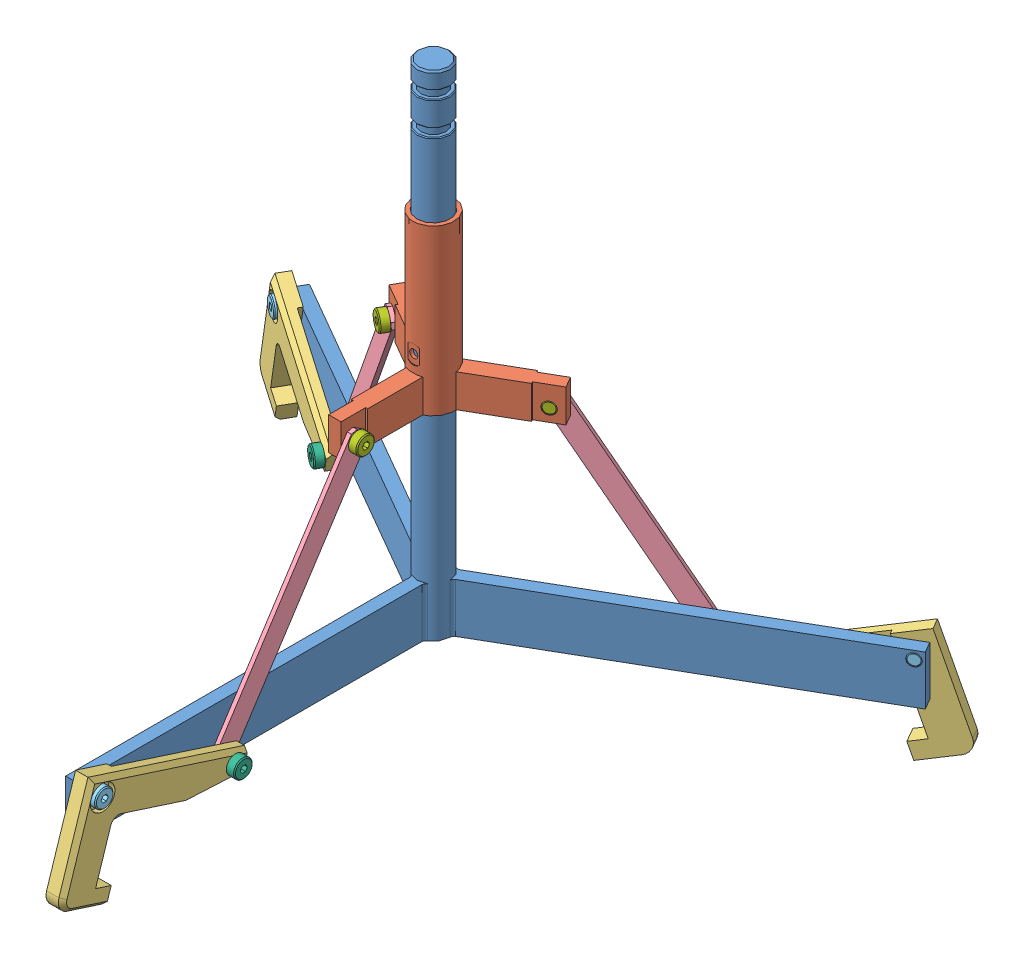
SolidWorks assembly Claw-Mechanism.sldasm, configuration Default (file format 4700). Lengths in mm.
Overall size (537.4 450.84 475.02).
17 component instances, 7 part files, 12 mates.
Components (placement in the parent):
- Center-Post-1: Center-Post.sldprt [Default] at (243.2769 -145.5931 -226.6708) size (488.7 381 423.22)
- Collar-1: Collar.sldprt [Default] at (243.2769 7.2865 -226.6708) size (136.74 127 118.42)
- Claw-1: Claw.sldprt [Default] at (260.7394 -113.8431 46.3792) x (0 0.307291 0.951615) z (-1 0 0) size (127 82.55 12.7)
- Connecting-Rod-1: Connecting-Rod.sldprt [Default] at (251.4684 17.8182 -170.1107) x (0 -0.838902 0.544283) z (-1 0 0) size (203.2 15.88 3.17)
- Pin-Long-1: Pin-Long.sldprt [Default] at (255.9642 -113.8431 46.3792) x (0 -1 0) z (0 0 1) size (14.27 23.8 14.27)
- Pin-Short-1: Pin-Short.sldprt [Default] at (260.7394 -142.9993 -56.3099) x (0 -1 0) z (0 0 1) size (14.27 18.8 14.27)
- Pin-Medium-1: Pin-Medium.sldprt [Default] at (251.4684 16.8115 -159.9958) x (0 -1 0) z (0 0 1) size (14.27 19.3 14.27)
- Claw-2: Claw.sldprt [Default] at (-1.9226 -113.8431 -348.0728) x (-0.824123 0.307291 -0.475808) z (0.5 0 -0.866025) size (127 82.55 12.7)
- Claw-3: Claw.sldprt [Default] at (471.0139 -113.8431 -378.3187) x (0.824123 0.307291 -0.475808) z (0.5 0 0.866025) size (127 82.55 12.7)
- Pin-Medium-2: Pin-Medium.sldprt [Default] at (181.4389 16.8115 -252.9142) x (0 -1 0) z (-0.866025 0 -0.5) size (14.27 19.3 14.27)
- Pin-Medium-3: Pin-Medium.sldprt [Default] at (296.9234 16.8115 -267.1023) x (0 -1 0) z (0.866025 0 -0.5) size (14.27 19.3 14.27)
- Pin-Short-2: Pin-Short.sldprt [Default] at (87.0088 -142.9993 -296.7282) x (0 -1 0) z (-0.866025 0 -0.5) size (14.27 18.8 14.27)
- Pin-Short-3: Pin-Short.sldprt [Default] at (382.0825 -142.9993 -326.9742) x (0 -1 0) z (0.866025 0 -0.5) size (14.27 18.8 14.27)
- Pin-Long-2: Pin-Long.sldprt [Default] at (0.465 -113.8431 -352.2082) x (0 -1 0) z (-0.866025 0 -0.5) size (14.27 23.8 14.27)
- Pin-Long-3: Pin-Long.sldprt [Default] at (473.4015 -113.8431 -374.1833) x (0 -1 0) z (0.866025 0 -0.5) size (14.27 23.8 14.27)
- Connecting-Rod-2: Connecting-Rod.sldprt [Default] at (190.1987 17.8182 -247.8567) x (-0.471363 -0.838902 -0.272141) z (0.5 0 -0.866025) size (203.2 15.88 3.17)
- Connecting-Rod-3: Connecting-Rod.sldprt [Default] at (288.1636 17.8182 -262.0448) x (0.471363 -0.838902 -0.272141) z (0.5 0 0.866025) size (203.2 15.88 3.17)
Mates (geometry in assembly coordinates):
- Concentric11: concentric aligned: cylinder of Center-Post-1 through (243.2769 235.4069 -226.6708) axis (0 -1 0) radius 12.7; cylinder of Collar-1 through (243.2769 134.2865 -226.6708) axis (0 -1 0) radius 15.875
- Concentric21: concentric aligned: cylinder of Center-Post-1 through (255.9769 -113.8431 46.3792) axis (-1 0 0) radius 4.7625; cylinder of Claw-1 through (260.7394 -113.8431 46.3792) axis (-1 0 0) radius 4.7625
- Coincident11: coincident anti-aligned: plane of Center-Post-1 through (248.0394 -145.5931 52.7292) normal (1 0 0); plane of Claw-1 through (248.0394 -122.026 62.3674) normal (-1 0 0)
- Concentric31: concentric aligned: cylinder of Claw-1 through (260.7394 -142.9993 -56.3099) axis (-1 0 0) radius 4.7625; cylinder of Connecting-Rod-1 through (251.4684 -142.9993 -56.3099) axis (-1 0 0) radius 4.7625
- Coincident21: coincident anti-aligned: plane of Claw-1 through (251.4684 -129.8312 38.1963) normal (-1 0 0); plane of Connecting-Rod-1 through (251.4684 17.8182 -170.1107) normal (1 0 0)
- Concentric4: concentric anti-aligned: cylinder of Collar-1 through (227.4019 16.8115 -159.9958) axis (1 0 0) radius 4.7625; cylinder of Connecting-Rod-1 through (251.4684 16.8115 -159.9958) axis (-1 0 0) radius 4.7625
- Concentric51: concentric anti-aligned: cylinder of Claw-1 through (255.9642 -113.8431 46.3792) axis (1 0 0) radius 9.525; cylinder of Pin-Long-1 through (255.9642 -113.8431 46.3792) axis (-1 0 0) radius 4.7371
- Coincident31: coincident anti-aligned: plane of Claw-1 through (255.9642 -113.8431 46.3792) normal (1 0 0); plane of Pin-Long-1 through (255.9642 -113.8431 46.3792) normal (-1 0 0)
- Concentric61: concentric aligned: cylinder of Claw-1 through (260.7394 -142.9993 -56.3099) axis (-1 0 0) radius 4.7625; cylinder of Pin-Short-1 through (260.7394 -142.9993 -56.3099) axis (-1 0 0) radius 4.7371
- Coincident41: coincident anti-aligned: plane of Claw-1 through (260.7394 -122.026 62.3674) normal (1 0 0); plane of Pin-Short-1 through (260.7394 -142.9993 -56.3099) normal (-1 0 0)
- Concentric71: concentric aligned: cylinder of Connecting-Rod-1 through (251.4684 16.8115 -159.9958) axis (-1 0 0) radius 4.7625; cylinder of Pin-Medium-1 through (251.4684 16.8115 -159.9958) axis (-1 0 0) radius 4.7371
- Coincident51: coincident anti-aligned: plane of Connecting-Rod-1 through (251.4684 17.8182 -170.1107) normal (1 0 0); plane of Pin-Medium-1 through (251.4684 16.8115 -159.9958) normal (-1 0 0)
